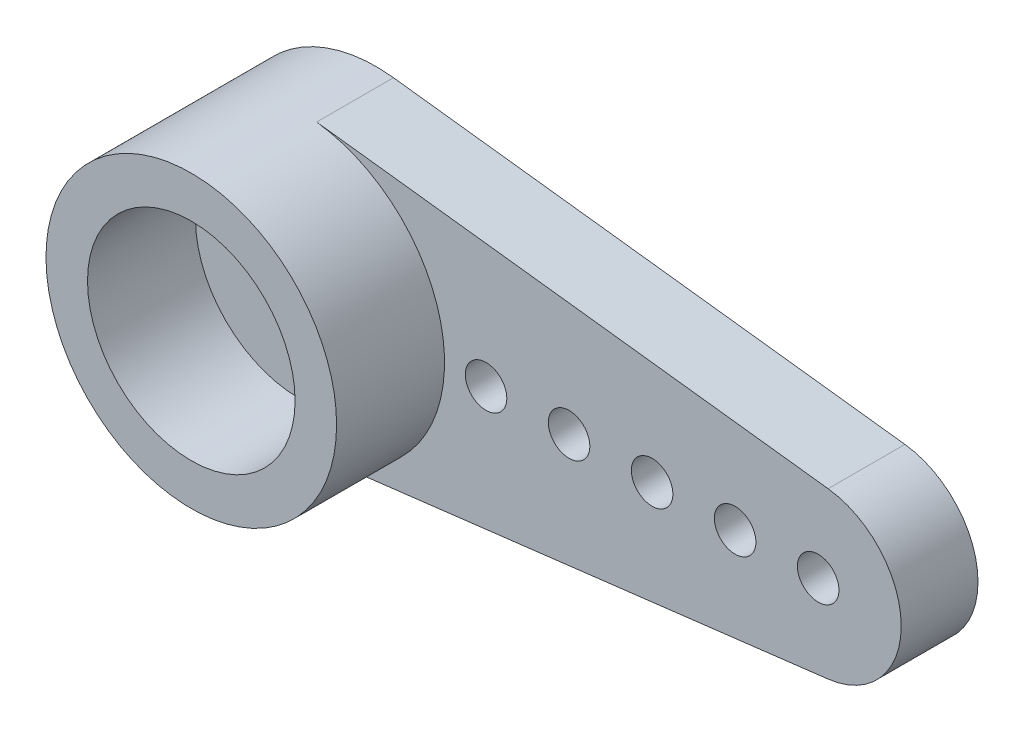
ISO-10303-21;
HEADER;
FILE_DESCRIPTION(('STEP AP214'),'2;1');
FILE_NAME('part.step','',(''),(''),'','','');
FILE_SCHEMA(('AUTOMOTIVE_DESIGN { 1 0 10303 214 1 1 1 1 }'));
ENDSEC;
DATA;
#1=APPLICATION_CONTEXT('core data for automotive mechanical design processes');
#2=APPLICATION_PROTOCOL_DEFINITION('international standard','automotive_design',2000,#1);
#3=PRODUCT_CONTEXT('',#1,'mechanical');
#4=PRODUCT('Part','Part','',(#3));
#5=PRODUCT_RELATED_PRODUCT_CATEGORY('part','',(#4));
#6=PRODUCT_DEFINITION_FORMATION('','',#4);
#7=PRODUCT_DEFINITION_CONTEXT('part definition',#1,'design');
#8=PRODUCT_DEFINITION('design','',#6,#7);
#9=PRODUCT_DEFINITION_SHAPE('','',#8);
#10=(LENGTH_UNIT() NAMED_UNIT(*) SI_UNIT(.MILLI.,.METRE.));
#11=(NAMED_UNIT(*) PLANE_ANGLE_UNIT() SI_UNIT($,.RADIAN.));
#12=(NAMED_UNIT(*) SI_UNIT($,.STERADIAN.) SOLID_ANGLE_UNIT());
#13=UNCERTAINTY_MEASURE_WITH_UNIT(LENGTH_MEASURE(1.E-05),#10,'distance_accuracy_value','');
#14=(GEOMETRIC_REPRESENTATION_CONTEXT(3) GLOBAL_UNCERTAINTY_ASSIGNED_CONTEXT((#13)) GLOBAL_UNIT_ASSIGNED_CONTEXT((#10,
#11,#12)) REPRESENTATION_CONTEXT('',''));
#15=CARTESIAN_POINT('',(0.,0.,0.));
#16=DIRECTION('',(0.,0.,1.));
#17=DIRECTION('',(1.,0.,0.));
#18=AXIS2_PLACEMENT_3D('',#15,#16,#17);
#19=CARTESIAN_POINT('',(0.,0.,0.));
#20=DIRECTION('',(0.,0.,1.));
#21=DIRECTION('',(1.,0.,0.));
#22=AXIS2_PLACEMENT_3D('',#19,#20,#21);
#23=PLANE('',#22);
#24=CARTESIAN_POINT('',(0.,0.,0.));
#25=DIRECTION('',(0.,0.,1.));
#26=DIRECTION('',(1.,0.,0.));
#27=AXIS2_PLACEMENT_3D('',#24,#25,#26);
#28=CIRCLE('',#27,3.5);
#29=CARTESIAN_POINT('',(0.42,3.47470862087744,0.));
#30=VERTEX_POINT('',#29);
#31=CARTESIAN_POINT('',(0.419999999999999,-3.47470862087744,0.));
#32=VERTEX_POINT('',#31);
#33=EDGE_CURVE('E78',#30,#32,#28,.T.);
#34=ORIENTED_EDGE('',*,*,#33,.F.);
#35=DIRECTION('',(-0.992773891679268,0.12,0.));
#36=VECTOR('',#35,1.);
#37=CARTESIAN_POINT('',(0.42,3.47470862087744,0.));
#38=LINE('',#37,#36);
#39=CARTESIAN_POINT('',(12.74,1.98554778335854,0.));
#40=VERTEX_POINT('',#39);
#41=EDGE_CURVE('E91',#40,#30,#38,.T.);
#42=ORIENTED_EDGE('',*,*,#41,.F.);
#43=CARTESIAN_POINT('',(12.5,0.,0.));
#44=DIRECTION('',(0.,0.,1.));
#45=DIRECTION('',(1.,0.,0.));
#46=AXIS2_PLACEMENT_3D('',#43,#44,#45);
#47=CIRCLE('',#46,2.);
#48=CARTESIAN_POINT('',(12.74,-1.98554778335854,0.));
#49=VERTEX_POINT('',#48);
#50=EDGE_CURVE('E72',#49,#40,#47,.T.);
#51=ORIENTED_EDGE('',*,*,#50,.F.);
#52=DIRECTION('',(0.992773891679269,0.12,0.));
#53=VECTOR('',#52,1.);
#54=CARTESIAN_POINT('',(12.74,-1.98554778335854,0.));
#55=LINE('',#54,#53);
#56=EDGE_CURVE('E118',#32,#49,#55,.T.);
#57=ORIENTED_EDGE('',*,*,#56,.F.);
#58=EDGE_LOOP('',(#34,#42,#51,#57));
#59=FACE_BOUND('',#58,.T.);
#60=CARTESIAN_POINT('',(12.5,0.,0.));
#61=DIRECTION('',(0.,0.,1.));
#62=DIRECTION('',(1.,0.,0.));
#63=AXIS2_PLACEMENT_3D('',#60,#61,#62);
#64=CIRCLE('',#63,0.499999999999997);
#65=CARTESIAN_POINT('',(13.,0.,0.));
#66=VERTEX_POINT('',#65);
#67=EDGE_CURVE('E121',#66,#66,#64,.T.);
#68=ORIENTED_EDGE('',*,*,#67,.T.);
#69=EDGE_LOOP('',(#68));
#70=FACE_BOUND('',#69,.T.);
#71=CARTESIAN_POINT('',(10.5,0.,0.));
#72=DIRECTION('',(0.,0.,1.));
#73=DIRECTION('',(1.,0.,0.));
#74=AXIS2_PLACEMENT_3D('',#71,#72,#73);
#75=CIRCLE('',#74,0.499999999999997);
#76=CARTESIAN_POINT('',(11.,0.,0.));
#77=VERTEX_POINT('',#76);
#78=EDGE_CURVE('E128',#77,#77,#75,.T.);
#79=ORIENTED_EDGE('',*,*,#78,.T.);
#80=EDGE_LOOP('',(#79));
#81=FACE_BOUND('',#80,.T.);
#82=CARTESIAN_POINT('',(8.5,0.,0.));
#83=DIRECTION('',(0.,0.,1.));
#84=DIRECTION('',(1.,0.,0.));
#85=AXIS2_PLACEMENT_3D('',#82,#83,#84);
#86=CIRCLE('',#85,0.499999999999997);
#87=CARTESIAN_POINT('',(9.,0.,0.));
#88=VERTEX_POINT('',#87);
#89=EDGE_CURVE('E134',#88,#88,#86,.T.);
#90=ORIENTED_EDGE('',*,*,#89,.T.);
#91=EDGE_LOOP('',(#90));
#92=FACE_BOUND('',#91,.T.);
#93=CARTESIAN_POINT('',(6.5,0.,0.));
#94=DIRECTION('',(0.,0.,1.));
#95=DIRECTION('',(1.,0.,0.));
#96=AXIS2_PLACEMENT_3D('',#93,#94,#95);
#97=CIRCLE('',#96,0.499999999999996);
#98=CARTESIAN_POINT('',(6.99999999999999,0.,0.));
#99=VERTEX_POINT('',#98);
#100=EDGE_CURVE('E140',#99,#99,#97,.T.);
#101=ORIENTED_EDGE('',*,*,#100,.T.);
#102=EDGE_LOOP('',(#101));
#103=FACE_BOUND('',#102,.T.);
#104=CARTESIAN_POINT('',(4.5,0.,0.));
#105=DIRECTION('',(0.,0.,1.));
#106=DIRECTION('',(1.,0.,0.));
#107=AXIS2_PLACEMENT_3D('',#104,#105,#106);
#108=CIRCLE('',#107,0.499999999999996);
#109=CARTESIAN_POINT('',(4.99999999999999,0.,0.));
#110=VERTEX_POINT('',#109);
#111=EDGE_CURVE('E146',#110,#110,#108,.T.);
#112=ORIENTED_EDGE('',*,*,#111,.T.);
#113=EDGE_LOOP('',(#112));
#114=FACE_BOUND('',#113,.T.);
#115=CARTESIAN_POINT('',(0.,0.,0.));
#116=DIRECTION('',(0.,0.,1.));
#117=DIRECTION('',(1.,0.,0.));
#118=AXIS2_PLACEMENT_3D('',#115,#116,#117);
#119=CIRCLE('',#118,2.75);
#120=CARTESIAN_POINT('',(2.75,0.,0.));
#121=VERTEX_POINT('',#120);
#122=EDGE_CURVE('E11',#121,#121,#119,.F.);
#123=ORIENTED_EDGE('',*,*,#122,.F.);
#124=EDGE_LOOP('',(#123));
#125=FACE_BOUND('',#124,.T.);
#126=ADVANCED_FACE('F38',(#59,#70,#81,#92,#103,#114,#125),#23,.F.);
#127=CARTESIAN_POINT('',(0.,0.,1.85));
#128=DIRECTION('',(0.,0.,-1.));
#129=DIRECTION('',(-1.,0.,0.));
#130=AXIS2_PLACEMENT_3D('',#127,#128,#129);
#131=CYLINDRICAL_SURFACE('',#130,3.5);
#132=DIRECTION('',(0.,0.,-1.));
#133=VECTOR('',#132,1.);
#134=CARTESIAN_POINT('',(0.42,3.47470862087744,1.85));
#135=LINE('',#134,#133);
#136=CARTESIAN_POINT('',(0.42,3.47470862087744,1.85));
#137=VERTEX_POINT('',#136);
#138=EDGE_CURVE('E88',#137,#30,#135,.T.);
#139=ORIENTED_EDGE('',*,*,#138,.T.);
#140=ORIENTED_EDGE('',*,*,#33,.T.);
#141=DIRECTION('',(0.,0.,-1.));
#142=VECTOR('',#141,1.);
#143=CARTESIAN_POINT('',(0.419999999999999,-3.47470862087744,1.85));
#144=LINE('',#143,#142);
#145=CARTESIAN_POINT('',(0.419999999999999,-3.47470862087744,1.85));
#146=VERTEX_POINT('',#145);
#147=EDGE_CURVE('E100',#146,#32,#144,.T.);
#148=ORIENTED_EDGE('',*,*,#147,.F.);
#149=CARTESIAN_POINT('',(0.,0.,1.85));
#150=DIRECTION('',(0.,0.,1.));
#151=DIRECTION('',(1.,0.,0.));
#152=AXIS2_PLACEMENT_3D('',#149,#150,#151);
#153=CIRCLE('',#152,3.5);
#154=EDGE_CURVE('E47',#146,#137,#153,.T.);
#155=ORIENTED_EDGE('',*,*,#154,.T.);
#156=EDGE_LOOP('',(#139,#140,#148,#155));
#157=FACE_BOUND('',#156,.T.);
#158=CARTESIAN_POINT('',(0.,0.,4.45));
#159=DIRECTION('',(0.,0.,1.));
#160=DIRECTION('',(1.,0.,0.));
#161=AXIS2_PLACEMENT_3D('',#158,#159,#160);
#162=CIRCLE('',#161,3.5);
#163=CARTESIAN_POINT('',(3.5,0.,4.45));
#164=VERTEX_POINT('',#163);
#165=EDGE_CURVE('E152',#164,#164,#162,.T.);
#166=ORIENTED_EDGE('',*,*,#165,.F.);
#167=EDGE_LOOP('',(#166));
#168=FACE_BOUND('',#167,.T.);
#169=ADVANCED_FACE('F40',(#157,#168),#131,.T.);
#170=CARTESIAN_POINT('',(12.74,-1.98554778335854,1.85));
#171=DIRECTION('',(-0.12,0.992773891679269,0.));
#172=DIRECTION('',(-0.992773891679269,-0.12,0.));
#173=AXIS2_PLACEMENT_3D('',#170,#171,#172);
#174=PLANE('',#173);
#175=ORIENTED_EDGE('',*,*,#56,.T.);
#176=DIRECTION('',(0.,0.,-1.));
#177=VECTOR('',#176,1.);
#178=CARTESIAN_POINT('',(12.74,-1.98554778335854,1.85));
#179=LINE('',#178,#177);
#180=CARTESIAN_POINT('',(12.74,-1.98554778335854,1.85));
#181=VERTEX_POINT('',#180);
#182=EDGE_CURVE('E103',#181,#49,#179,.T.);
#183=ORIENTED_EDGE('',*,*,#182,.F.);
#184=DIRECTION('',(0.992773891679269,0.12,0.));
#185=VECTOR('',#184,1.);
#186=CARTESIAN_POINT('',(12.74,-1.98554778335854,1.85));
#187=LINE('',#186,#185);
#188=EDGE_CURVE('E116',#146,#181,#187,.T.);
#189=ORIENTED_EDGE('',*,*,#188,.F.);
#190=ORIENTED_EDGE('',*,*,#147,.T.);
#191=EDGE_LOOP('',(#175,#183,#189,#190));
#192=FACE_BOUND('',#191,.T.);
#193=ADVANCED_FACE('F227',(#192),#174,.F.);
#194=CARTESIAN_POINT('',(12.5,0.,1.85));
#195=DIRECTION('',(0.,0.,-1.));
#196=DIRECTION('',(-1.,0.,0.));
#197=AXIS2_PLACEMENT_3D('',#194,#195,#196);
#198=CYLINDRICAL_SURFACE('',#197,2.);
#199=ORIENTED_EDGE('',*,*,#50,.T.);
#200=DIRECTION('',(0.,0.,-1.));
#201=VECTOR('',#200,1.);
#202=CARTESIAN_POINT('',(12.74,1.98554778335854,1.85));
#203=LINE('',#202,#201);
#204=CARTESIAN_POINT('',(12.74,1.98554778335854,1.85));
#205=VERTEX_POINT('',#204);
#206=EDGE_CURVE('E93',#205,#40,#203,.T.);
#207=ORIENTED_EDGE('',*,*,#206,.F.);
#208=CARTESIAN_POINT('',(12.5,0.,1.85));
#209=DIRECTION('',(0.,0.,1.));
#210=DIRECTION('',(1.,0.,0.));
#211=AXIS2_PLACEMENT_3D('',#208,#209,#210);
#212=CIRCLE('',#211,2.);
#213=EDGE_CURVE('E55',#181,#205,#212,.T.);
#214=ORIENTED_EDGE('',*,*,#213,.F.);
#215=ORIENTED_EDGE('',*,*,#182,.T.);
#216=EDGE_LOOP('',(#199,#207,#214,#215));
#217=FACE_BOUND('',#216,.T.);
#218=ADVANCED_FACE('F234',(#217),#198,.T.);
#219=CARTESIAN_POINT('',(0.42,3.47470862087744,1.85));
#220=DIRECTION('',(-0.12,-0.992773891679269,0.));
#221=DIRECTION('',(0.992773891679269,-0.12,0.));
#222=AXIS2_PLACEMENT_3D('',#219,#220,#221);
#223=PLANE('',#222);
#224=ORIENTED_EDGE('',*,*,#41,.T.);
#225=ORIENTED_EDGE('',*,*,#138,.F.);
#226=DIRECTION('',(-0.992773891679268,0.12,0.));
#227=VECTOR('',#226,1.);
#228=CARTESIAN_POINT('',(0.42,3.47470862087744,1.85));
#229=LINE('',#228,#227);
#230=EDGE_CURVE('E90',#205,#137,#229,.T.);
#231=ORIENTED_EDGE('',*,*,#230,.F.);
#232=ORIENTED_EDGE('',*,*,#206,.T.);
#233=EDGE_LOOP('',(#224,#225,#231,#232));
#234=FACE_BOUND('',#233,.T.);
#235=ADVANCED_FACE('F89',(#234),#223,.F.);
#236=CARTESIAN_POINT('',(0.,0.,1.85));
#237=DIRECTION('',(0.,0.,1.));
#238=DIRECTION('',(1.,0.,0.));
#239=AXIS2_PLACEMENT_3D('',#236,#237,#238);
#240=PLANE('',#239);
#241=ORIENTED_EDGE('',*,*,#154,.F.);
#242=ORIENTED_EDGE('',*,*,#188,.T.);
#243=ORIENTED_EDGE('',*,*,#213,.T.);
#244=ORIENTED_EDGE('',*,*,#230,.T.);
#245=EDGE_LOOP('',(#241,#242,#243,#244));
#246=FACE_BOUND('',#245,.T.);
#247=CARTESIAN_POINT('',(4.5,0.,1.85));
#248=DIRECTION('',(0.,0.,1.));
#249=DIRECTION('',(1.,0.,0.));
#250=AXIS2_PLACEMENT_3D('',#247,#248,#249);
#251=CIRCLE('',#250,0.499999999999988);
#252=CARTESIAN_POINT('',(4.99999999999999,0.,1.85));
#253=VERTEX_POINT('',#252);
#254=EDGE_CURVE('E149',#253,#253,#251,.T.);
#255=ORIENTED_EDGE('',*,*,#254,.F.);
#256=EDGE_LOOP('',(#255));
#257=FACE_BOUND('',#256,.T.);
#258=CARTESIAN_POINT('',(6.5,0.,1.85));
#259=DIRECTION('',(0.,0.,1.));
#260=DIRECTION('',(1.,0.,0.));
#261=AXIS2_PLACEMENT_3D('',#258,#259,#260);
#262=CIRCLE('',#261,0.499999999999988);
#263=CARTESIAN_POINT('',(6.99999999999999,0.,1.85));
#264=VERTEX_POINT('',#263);
#265=EDGE_CURVE('E143',#264,#264,#262,.T.);
#266=ORIENTED_EDGE('',*,*,#265,.F.);
#267=EDGE_LOOP('',(#266));
#268=FACE_BOUND('',#267,.T.);
#269=CARTESIAN_POINT('',(8.5,0.,1.85));
#270=DIRECTION('',(0.,0.,1.));
#271=DIRECTION('',(1.,0.,0.));
#272=AXIS2_PLACEMENT_3D('',#269,#270,#271);
#273=CIRCLE('',#272,0.499999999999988);
#274=CARTESIAN_POINT('',(8.99999999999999,0.,1.85));
#275=VERTEX_POINT('',#274);
#276=EDGE_CURVE('E137',#275,#275,#273,.T.);
#277=ORIENTED_EDGE('',*,*,#276,.F.);
#278=EDGE_LOOP('',(#277));
#279=FACE_BOUND('',#278,.T.);
#280=CARTESIAN_POINT('',(10.5,0.,1.85));
#281=DIRECTION('',(0.,0.,1.));
#282=DIRECTION('',(1.,0.,0.));
#283=AXIS2_PLACEMENT_3D('',#280,#281,#282);
#284=CIRCLE('',#283,0.499999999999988);
#285=CARTESIAN_POINT('',(11.,0.,1.85));
#286=VERTEX_POINT('',#285);
#287=EDGE_CURVE('E131',#286,#286,#284,.T.);
#288=ORIENTED_EDGE('',*,*,#287,.F.);
#289=EDGE_LOOP('',(#288));
#290=FACE_BOUND('',#289,.T.);
#291=CARTESIAN_POINT('',(12.5,0.,1.85));
#292=DIRECTION('',(0.,0.,1.));
#293=DIRECTION('',(1.,0.,0.));
#294=AXIS2_PLACEMENT_3D('',#291,#292,#293);
#295=CIRCLE('',#294,0.499999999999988);
#296=CARTESIAN_POINT('',(13.,0.,1.85));
#297=VERTEX_POINT('',#296);
#298=EDGE_CURVE('E125',#297,#297,#295,.T.);
#299=ORIENTED_EDGE('',*,*,#298,.F.);
#300=EDGE_LOOP('',(#299));
#301=FACE_BOUND('',#300,.T.);
#302=ADVANCED_FACE('F95',(#246,#257,#268,#279,#290,#301),#240,.T.);
#303=CARTESIAN_POINT('',(12.5,0.,1.85));
#304=DIRECTION('',(0.,0.,1.));
#305=DIRECTION('',(1.,0.,0.));
#306=AXIS2_PLACEMENT_3D('',#303,#304,#305);
#307=CYLINDRICAL_SURFACE('',#306,0.499999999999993);
#308=ORIENTED_EDGE('',*,*,#67,.F.);
#309=EDGE_LOOP('',(#308));
#310=FACE_BOUND('',#309,.T.);
#311=ORIENTED_EDGE('',*,*,#298,.T.);
#312=EDGE_LOOP('',(#311));
#313=FACE_BOUND('',#312,.T.);
#314=ADVANCED_FACE('F262',(#310,#313),#307,.F.);
#315=CARTESIAN_POINT('',(10.5,0.,1.85));
#316=DIRECTION('',(0.,0.,1.));
#317=DIRECTION('',(1.,0.,0.));
#318=AXIS2_PLACEMENT_3D('',#315,#316,#317);
#319=CYLINDRICAL_SURFACE('',#318,0.499999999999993);
#320=ORIENTED_EDGE('',*,*,#78,.F.);
#321=EDGE_LOOP('',(#320));
#322=FACE_BOUND('',#321,.T.);
#323=ORIENTED_EDGE('',*,*,#287,.T.);
#324=EDGE_LOOP('',(#323));
#325=FACE_BOUND('',#324,.T.);
#326=ADVANCED_FACE('F268',(#322,#325),#319,.F.);
#327=CARTESIAN_POINT('',(8.5,0.,1.85));
#328=DIRECTION('',(0.,0.,1.));
#329=DIRECTION('',(1.,0.,0.));
#330=AXIS2_PLACEMENT_3D('',#327,#328,#329);
#331=CYLINDRICAL_SURFACE('',#330,0.499999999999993);
#332=ORIENTED_EDGE('',*,*,#89,.F.);
#333=EDGE_LOOP('',(#332));
#334=FACE_BOUND('',#333,.T.);
#335=ORIENTED_EDGE('',*,*,#276,.T.);
#336=EDGE_LOOP('',(#335));
#337=FACE_BOUND('',#336,.T.);
#338=ADVANCED_FACE('F275',(#334,#337),#331,.F.);
#339=CARTESIAN_POINT('',(6.5,0.,1.85));
#340=DIRECTION('',(0.,0.,1.));
#341=DIRECTION('',(1.,0.,0.));
#342=AXIS2_PLACEMENT_3D('',#339,#340,#341);
#343=CYLINDRICAL_SURFACE('',#342,0.499999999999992);
#344=ORIENTED_EDGE('',*,*,#100,.F.);
#345=EDGE_LOOP('',(#344));
#346=FACE_BOUND('',#345,.T.);
#347=ORIENTED_EDGE('',*,*,#265,.T.);
#348=EDGE_LOOP('',(#347));
#349=FACE_BOUND('',#348,.T.);
#350=ADVANCED_FACE('F283',(#346,#349),#343,.F.);
#351=CARTESIAN_POINT('',(4.5,0.,1.85));
#352=DIRECTION('',(0.,0.,1.));
#353=DIRECTION('',(1.,0.,0.));
#354=AXIS2_PLACEMENT_3D('',#351,#352,#353);
#355=CYLINDRICAL_SURFACE('',#354,0.499999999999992);
#356=ORIENTED_EDGE('',*,*,#111,.F.);
#357=EDGE_LOOP('',(#356));
#358=FACE_BOUND('',#357,.T.);
#359=ORIENTED_EDGE('',*,*,#254,.T.);
#360=EDGE_LOOP('',(#359));
#361=FACE_BOUND('',#360,.T.);
#362=ADVANCED_FACE('F291',(#358,#361),#355,.F.);
#363=CARTESIAN_POINT('',(0.,0.,4.45));
#364=DIRECTION('',(0.,0.,1.));
#365=DIRECTION('',(1.,0.,0.));
#366=AXIS2_PLACEMENT_3D('',#363,#364,#365);
#367=PLANE('',#366);
#368=CARTESIAN_POINT('',(0.,0.,4.45));
#369=DIRECTION('',(0.,0.,-1.));
#370=DIRECTION('',(-1.,0.,0.));
#371=AXIS2_PLACEMENT_3D('',#368,#369,#370);
#372=CIRCLE('',#371,2.5);
#373=CARTESIAN_POINT('',(-2.5,0.,4.45));
#374=VERTEX_POINT('',#373);
#375=EDGE_CURVE('E173',#374,#374,#372,.T.);
#376=ORIENTED_EDGE('',*,*,#375,.T.);
#377=EDGE_LOOP('',(#376));
#378=FACE_BOUND('',#377,.T.);
#379=ORIENTED_EDGE('',*,*,#165,.T.);
#380=EDGE_LOOP('',(#379));
#381=FACE_BOUND('',#380,.T.);
#382=ADVANCED_FACE('F177',(#378,#381),#367,.T.);
#383=CARTESIAN_POINT('',(0.,0.,-0.5));
#384=DIRECTION('',(0.,0.,1.));
#385=DIRECTION('',(1.,0.,0.));
#386=AXIS2_PLACEMENT_3D('',#383,#384,#385);
#387=CYLINDRICAL_SURFACE('',#386,2.75);
#388=CARTESIAN_POINT('',(0.,0.,-0.5));
#389=DIRECTION('',(0.,0.,-1.));
#390=DIRECTION('',(-1.,0.,0.));
#391=AXIS2_PLACEMENT_3D('',#388,#389,#390);
#392=CIRCLE('',#391,2.75);
#393=CARTESIAN_POINT('',(-2.75,0.,-0.5));
#394=VERTEX_POINT('',#393);
#395=EDGE_CURVE('E155',#394,#394,#392,.T.);
#396=ORIENTED_EDGE('',*,*,#395,.F.);
#397=EDGE_LOOP('',(#396));
#398=FACE_BOUND('',#397,.T.);
#399=ORIENTED_EDGE('',*,*,#122,.T.);
#400=EDGE_LOOP('',(#399));
#401=FACE_BOUND('',#400,.T.);
#402=ADVANCED_FACE('F213',(#398,#401),#387,.T.);
#403=CARTESIAN_POINT('',(0.,0.,-0.5));
#404=DIRECTION('',(0.,0.,-1.));
#405=DIRECTION('',(-1.,0.,0.));
#406=AXIS2_PLACEMENT_3D('',#403,#404,#405);
#407=PLANE('',#406);
#408=CARTESIAN_POINT('',(0.,0.,-0.5));
#409=DIRECTION('',(0.,0.,-1.));
#410=DIRECTION('',(-1.,0.,0.));
#411=AXIS2_PLACEMENT_3D('',#408,#409,#410);
#412=CIRCLE('',#411,2.2);
#413=CARTESIAN_POINT('',(-2.2,0.,-0.5));
#414=VERTEX_POINT('',#413);
#415=EDGE_CURVE('E158',#414,#414,#412,.T.);
#416=ORIENTED_EDGE('',*,*,#415,.F.);
#417=EDGE_LOOP('',(#416));
#418=FACE_BOUND('',#417,.T.);
#419=ORIENTED_EDGE('',*,*,#395,.T.);
#420=EDGE_LOOP('',(#419));
#421=FACE_BOUND('',#420,.T.);
#422=ADVANCED_FACE('F207',(#418,#421),#407,.T.);
#423=CARTESIAN_POINT('',(0.,0.,0.));
#424=DIRECTION('',(0.,0.,-1.));
#425=DIRECTION('',(-1.,0.,0.));
#426=AXIS2_PLACEMENT_3D('',#423,#424,#425);
#427=CYLINDRICAL_SURFACE('',#426,2.2);
#428=CARTESIAN_POINT('',(0.,0.,0.699999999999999));
#429=DIRECTION('',(0.,0.,-1.));
#430=DIRECTION('',(-1.,0.,0.));
#431=AXIS2_PLACEMENT_3D('',#428,#429,#430);
#432=CIRCLE('',#431,2.2);
#433=CARTESIAN_POINT('',(-2.2,0.,0.7));
#434=VERTEX_POINT('',#433);
#435=EDGE_CURVE('E161',#434,#434,#432,.T.);
#436=ORIENTED_EDGE('',*,*,#435,.F.);
#437=EDGE_LOOP('',(#436));
#438=FACE_BOUND('',#437,.T.);
#439=ORIENTED_EDGE('',*,*,#415,.T.);
#440=EDGE_LOOP('',(#439));
#441=FACE_BOUND('',#440,.T.);
#442=ADVANCED_FACE('F201',(#438,#441),#427,.F.);
#443=CARTESIAN_POINT('',(-2.2,0.,0.7));
#444=DIRECTION('',(0.,0.,1.));
#445=DIRECTION('',(1.,0.,0.));
#446=AXIS2_PLACEMENT_3D('',#443,#444,#445);
#447=PLANE('',#446);
#448=CARTESIAN_POINT('',(0.,0.,0.7));
#449=DIRECTION('',(0.,0.,-1.));
#450=DIRECTION('',(-1.,0.,0.));
#451=AXIS2_PLACEMENT_3D('',#448,#449,#450);
#452=CIRCLE('',#451,1.1);
#453=CARTESIAN_POINT('',(-1.1,0.,0.7));
#454=VERTEX_POINT('',#453);
#455=EDGE_CURVE('E164',#454,#454,#452,.T.);
#456=ORIENTED_EDGE('',*,*,#455,.F.);
#457=EDGE_LOOP('',(#456));
#458=FACE_BOUND('',#457,.T.);
#459=ORIENTED_EDGE('',*,*,#435,.T.);
#460=EDGE_LOOP('',(#459));
#461=FACE_BOUND('',#460,.T.);
#462=ADVANCED_FACE('F195',(#458,#461),#447,.F.);
#463=CARTESIAN_POINT('',(0.,0.,0.));
#464=DIRECTION('',(0.,0.,-1.));
#465=DIRECTION('',(-1.,0.,0.));
#466=AXIS2_PLACEMENT_3D('',#463,#464,#465);
#467=CYLINDRICAL_SURFACE('',#466,1.1);
#468=CARTESIAN_POINT('',(0.,0.,1.85));
#469=DIRECTION('',(0.,0.,-1.));
#470=DIRECTION('',(-1.,0.,0.));
#471=AXIS2_PLACEMENT_3D('',#468,#469,#470);
#472=CIRCLE('',#471,1.1);
#473=CARTESIAN_POINT('',(-1.1,0.,1.85));
#474=VERTEX_POINT('',#473);
#475=EDGE_CURVE('E167',#474,#474,#472,.T.);
#476=ORIENTED_EDGE('',*,*,#475,.F.);
#477=EDGE_LOOP('',(#476));
#478=FACE_BOUND('',#477,.T.);
#479=ORIENTED_EDGE('',*,*,#455,.T.);
#480=EDGE_LOOP('',(#479));
#481=FACE_BOUND('',#480,.T.);
#482=ADVANCED_FACE('F189',(#478,#481),#467,.F.);
#483=CARTESIAN_POINT('',(-1.1,0.,1.85));
#484=DIRECTION('',(0.,0.,-1.));
#485=DIRECTION('',(-1.,0.,0.));
#486=AXIS2_PLACEMENT_3D('',#483,#484,#485);
#487=PLANE('',#486);
#488=CARTESIAN_POINT('',(0.,0.,1.85));
#489=DIRECTION('',(0.,0.,-1.));
#490=DIRECTION('',(-1.,0.,0.));
#491=AXIS2_PLACEMENT_3D('',#488,#489,#490);
#492=CIRCLE('',#491,2.5);
#493=CARTESIAN_POINT('',(-2.5,0.,1.85));
#494=VERTEX_POINT('',#493);
#495=EDGE_CURVE('E170',#494,#494,#492,.T.);
#496=ORIENTED_EDGE('',*,*,#495,.F.);
#497=EDGE_LOOP('',(#496));
#498=FACE_BOUND('',#497,.T.);
#499=ORIENTED_EDGE('',*,*,#475,.T.);
#500=EDGE_LOOP('',(#499));
#501=FACE_BOUND('',#500,.T.);
#502=ADVANCED_FACE('F183',(#498,#501),#487,.F.);
#503=CARTESIAN_POINT('',(0.,0.,0.));
#504=DIRECTION('',(0.,0.,-1.));
#505=DIRECTION('',(-1.,0.,0.));
#506=AXIS2_PLACEMENT_3D('',#503,#504,#505);
#507=CYLINDRICAL_SURFACE('',#506,2.5);
#508=ORIENTED_EDGE('',*,*,#375,.F.);
#509=EDGE_LOOP('',(#508));
#510=FACE_BOUND('',#509,.T.);
#511=ORIENTED_EDGE('',*,*,#495,.T.);
#512=EDGE_LOOP('',(#511));
#513=FACE_BOUND('',#512,.T.);
#514=ADVANCED_FACE('F180',(#510,#513),#507,.F.);
#515=CLOSED_SHELL('',(#126,#169,#193,#218,#235,#302,#314,#326,#338,#350,#362,#382,#402,#422,
#442,#462,#482,#502,#514));
#516=MANIFOLD_SOLID_BREP('B2',#515);
#517=ADVANCED_BREP_SHAPE_REPRESENTATION('',(#18,#516),#14);
#518=SHAPE_DEFINITION_REPRESENTATION(#9,#517);
ENDSEC;
END-ISO-10303-21;
